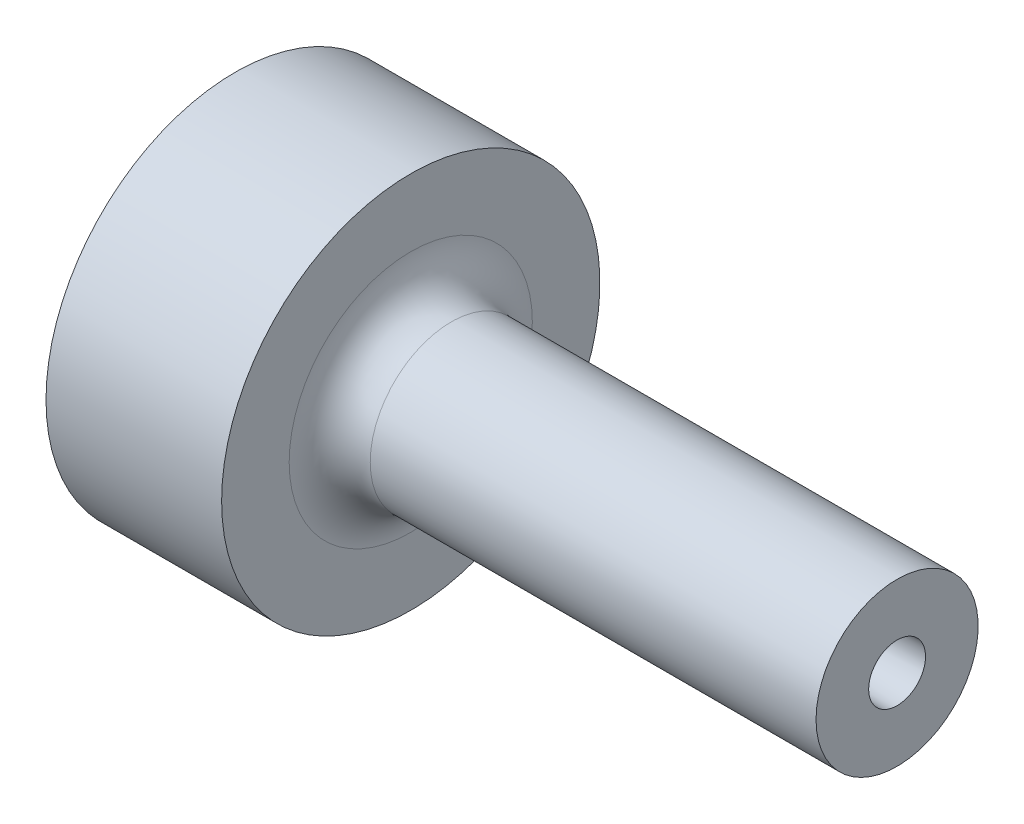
ISO-10303-21;
HEADER;
FILE_DESCRIPTION(('STEP AP214'),'2;1');
FILE_NAME('part.step','',(''),(''),'','','');
FILE_SCHEMA(('AUTOMOTIVE_DESIGN { 1 0 10303 214 1 1 1 1 }'));
ENDSEC;
DATA;
#1=APPLICATION_CONTEXT('core data for automotive mechanical design processes');
#2=APPLICATION_PROTOCOL_DEFINITION('international standard','automotive_design',2000,#1);
#3=PRODUCT_CONTEXT('',#1,'mechanical');
#4=PRODUCT('Part','Part','',(#3));
#5=PRODUCT_RELATED_PRODUCT_CATEGORY('part','',(#4));
#6=PRODUCT_DEFINITION_FORMATION('','',#4);
#7=PRODUCT_DEFINITION_CONTEXT('part definition',#1,'design');
#8=PRODUCT_DEFINITION('design','',#6,#7);
#9=PRODUCT_DEFINITION_SHAPE('','',#8);
#10=(LENGTH_UNIT() NAMED_UNIT(*) SI_UNIT(.MILLI.,.METRE.));
#11=(NAMED_UNIT(*) PLANE_ANGLE_UNIT() SI_UNIT($,.RADIAN.));
#12=(NAMED_UNIT(*) SI_UNIT($,.STERADIAN.) SOLID_ANGLE_UNIT());
#13=UNCERTAINTY_MEASURE_WITH_UNIT(LENGTH_MEASURE(1.E-05),#10,'distance_accuracy_value','');
#14=(GEOMETRIC_REPRESENTATION_CONTEXT(3) GLOBAL_UNCERTAINTY_ASSIGNED_CONTEXT((#13)) GLOBAL_UNIT_ASSIGNED_CONTEXT((#10,
#11,#12)) REPRESENTATION_CONTEXT('',''));
#15=CARTESIAN_POINT('',(0.,0.,0.));
#16=DIRECTION('',(0.,0.,1.));
#17=DIRECTION('',(1.,0.,0.));
#18=AXIS2_PLACEMENT_3D('',#15,#16,#17);
#19=CARTESIAN_POINT('',(0.,0.,0.));
#20=DIRECTION('',(-1.,0.,0.));
#21=DIRECTION('',(0.,0.,1.));
#22=AXIS2_PLACEMENT_3D('',#19,#20,#21);
#23=CYLINDRICAL_SURFACE('',#22,14.);
#24=CARTESIAN_POINT('',(13.,0.,0.));
#25=DIRECTION('',(-1.,0.,0.));
#26=DIRECTION('',(0.,0.,1.));
#27=AXIS2_PLACEMENT_3D('',#24,#25,#26);
#28=CIRCLE('',#27,14.);
#29=CARTESIAN_POINT('',(13.,0.,14.));
#30=VERTEX_POINT('',#29);
#31=EDGE_CURVE('E88',#30,#30,#28,.T.);
#32=ORIENTED_EDGE('',*,*,#31,.T.);
#33=EDGE_LOOP('',(#32));
#34=FACE_BOUND('',#33,.T.);
#35=CARTESIAN_POINT('',(0.,0.,0.));
#36=DIRECTION('',(-1.,0.,0.));
#37=DIRECTION('',(0.,0.,1.));
#38=AXIS2_PLACEMENT_3D('',#35,#36,#37);
#39=CIRCLE('',#38,14.);
#40=CARTESIAN_POINT('',(0.,0.,14.));
#41=VERTEX_POINT('',#40);
#42=EDGE_CURVE('E83',#41,#41,#39,.T.);
#43=ORIENTED_EDGE('',*,*,#42,.F.);
#44=EDGE_LOOP('',(#43));
#45=FACE_BOUND('',#44,.T.);
#46=CARTESIAN_POINT('',(6.5,-13.856406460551,-2.));
#47=CARTESIAN_POINT('',(6.61172417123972,-13.8564082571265,-1.99999534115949));
#48=CARTESIAN_POINT('',(6.72351471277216,-13.8577723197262,-1.99060664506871));
#49=CARTESIAN_POINT('',(6.9439746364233,-13.8630779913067,-1.95330740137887));
#50=CARTESIAN_POINT('',(7.05264079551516,-13.8670221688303,-1.92537839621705));
#51=CARTESIAN_POINT('',(7.26362870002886,-13.8770324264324,-1.85184738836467));
#52=CARTESIAN_POINT('',(7.36595507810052,-13.8830969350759,-1.80625847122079));
#53=CARTESIAN_POINT('',(7.56148972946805,-13.8966626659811,-1.69873175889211));
#54=CARTESIAN_POINT('',(7.65469934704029,-13.9041636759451,-1.63679637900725));
#55=CARTESIAN_POINT('',(7.83004829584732,-13.9198182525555,-1.49785346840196));
#56=CARTESIAN_POINT('',(7.91211171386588,-13.9279757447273,-1.42075056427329));
#57=CARTESIAN_POINT('',(8.06218155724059,-13.9439890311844,-1.25386707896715));
#58=CARTESIAN_POINT('',(8.13018723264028,-13.9518448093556,-1.16408582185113));
#59=CARTESIAN_POINT('',(8.25048909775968,-13.9664103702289,-0.973910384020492));
#60=CARTESIAN_POINT('',(8.30271571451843,-13.9731150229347,-0.873471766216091));
#61=CARTESIAN_POINT('',(8.38953073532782,-13.9845795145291,-0.665136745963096));
#62=CARTESIAN_POINT('',(8.4241199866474,-13.9893394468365,-0.557240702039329));
#63=CARTESIAN_POINT('',(8.47444920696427,-13.9963505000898,-0.337834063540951));
#64=CARTESIAN_POINT('',(8.49031606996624,-13.9986185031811,-0.226353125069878));
#65=CARTESIAN_POINT('',(8.5031438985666,-14.0004479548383,-0.00228956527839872));
#66=CARTESIAN_POINT('',(8.50010582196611,-14.0000095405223,0.110292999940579));
#67=CARTESIAN_POINT('',(8.47531062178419,-13.9964890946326,0.33249899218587));
#68=CARTESIAN_POINT('',(8.45369000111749,-13.9934263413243,0.442137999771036));
#69=CARTESIAN_POINT('',(8.39255744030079,-13.9850228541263,0.656215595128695));
#70=CARTESIAN_POINT('',(8.3530450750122,-13.9796820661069,0.760654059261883));
#71=CARTESIAN_POINT('',(8.25710925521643,-13.9672894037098,0.961781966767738));
#72=CARTESIAN_POINT('',(8.20062784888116,-13.9602316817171,1.05844339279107));
#73=CARTESIAN_POINT('',(8.07239950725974,-13.9451926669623,1.24096782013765));
#74=CARTESIAN_POINT('',(8.00065165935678,-13.9372113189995,1.32683017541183));
#75=CARTESIAN_POINT('',(7.843165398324,-13.921132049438,1.48612299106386));
#76=CARTESIAN_POINT('',(7.75730786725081,-13.9130337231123,1.55943569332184));
#77=CARTESIAN_POINT('',(7.57444547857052,-13.8977029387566,1.69062989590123));
#78=CARTESIAN_POINT('',(7.47744056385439,-13.890470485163,1.74851131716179));
#79=CARTESIAN_POINT('',(7.27491971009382,-13.8776905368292,1.84721301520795));
#80=CARTESIAN_POINT('',(7.1693981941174,-13.8721441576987,1.88802200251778));
#81=CARTESIAN_POINT('',(6.95290242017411,-13.8633846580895,1.9513062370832));
#82=CARTESIAN_POINT('',(6.84192850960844,-13.8601713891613,1.97378265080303));
#83=CARTESIAN_POINT('',(6.61872346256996,-13.8564698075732,1.99960390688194));
#84=CARTESIAN_POINT('',(6.50651197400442,-13.8559577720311,2.00311531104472));
#85=CARTESIAN_POINT('',(6.28310219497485,-13.8576537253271,1.9913480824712));
#86=CARTESIAN_POINT('',(6.17190387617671,-13.8598616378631,1.9760699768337));
#87=CARTESIAN_POINT('',(5.95418781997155,-13.8667269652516,1.92729837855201));
#88=CARTESIAN_POINT('',(5.84765127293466,-13.8713733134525,1.8938871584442));
#89=CARTESIAN_POINT('',(5.6416912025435,-13.8825829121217,1.80988306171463));
#90=CARTESIAN_POINT('',(5.54226800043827,-13.8891462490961,1.75928940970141));
#91=CARTESIAN_POINT('',(5.35260812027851,-13.9035064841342,1.64195360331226));
#92=CARTESIAN_POINT('',(5.26243903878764,-13.911311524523,1.57510320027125));
#93=CARTESIAN_POINT('',(5.09454027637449,-13.9272509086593,1.42730277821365));
#94=CARTESIAN_POINT('',(5.01681123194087,-13.9353852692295,1.34635203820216));
#95=CARTESIAN_POINT('',(4.8754047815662,-13.9511405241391,1.17191708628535));
#96=CARTESIAN_POINT('',(4.81183747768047,-13.9587570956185,1.07834317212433));
#97=CARTESIAN_POINT('',(4.70132443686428,-13.972552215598,0.881748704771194));
#98=CARTESIAN_POINT('',(4.65437828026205,-13.9787308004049,0.778728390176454));
#99=CARTESIAN_POINT('',(4.57861788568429,-13.9889347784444,0.566515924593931));
#100=CARTESIAN_POINT('',(4.54974241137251,-13.9929674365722,0.457345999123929));
#101=CARTESIAN_POINT('',(4.51074453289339,-13.9984555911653,0.235645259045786));
#102=CARTESIAN_POINT('',(4.50062101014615,-13.9999112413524,0.123114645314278));
#103=CARTESIAN_POINT('',(4.49943976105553,-14.0000800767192,-0.101043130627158));
#104=CARTESIAN_POINT('',(4.50821318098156,-13.998817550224,-0.212669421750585));
#105=CARTESIAN_POINT('',(4.54421615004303,-13.9937406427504,-0.432842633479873));
#106=CARTESIAN_POINT('',(4.57144565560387,-13.989926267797,-0.541389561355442));
#107=CARTESIAN_POINT('',(4.6435299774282,-13.9801722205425,-0.752283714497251));
#108=CARTESIAN_POINT('',(4.68837418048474,-13.9742338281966,-0.854634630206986));
#109=CARTESIAN_POINT('',(4.79439714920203,-13.960885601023,-1.05038570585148));
#110=CARTESIAN_POINT('',(4.8555763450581,-13.9534757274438,-1.14378562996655));
#111=CARTESIAN_POINT('',(4.99314771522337,-13.9379304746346,-1.31984194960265));
#112=CARTESIAN_POINT('',(5.06966490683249,-13.9297894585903,-1.40240016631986));
#113=CARTESIAN_POINT('',(5.2354775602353,-13.9137422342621,-1.55356716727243));
#114=CARTESIAN_POINT('',(5.32477602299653,-13.9058360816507,-1.6221726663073));
#115=CARTESIAN_POINT('',(5.51414543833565,-13.8911108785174,-1.74379523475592));
#116=CARTESIAN_POINT('',(5.61426869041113,-13.8842975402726,-1.79673154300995));
#117=CARTESIAN_POINT('',(5.82203229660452,-13.8725962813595,-1.88495902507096));
#118=CARTESIAN_POINT('',(5.92966459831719,-13.8677063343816,-1.92026877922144));
#119=CARTESIAN_POINT('',(6.11483642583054,-13.8615529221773,-1.96409255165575));
#120=CARTESIAN_POINT('',(6.19122433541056,-13.859633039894,-1.97753762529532));
#121=CARTESIAN_POINT('',(6.34506419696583,-13.857059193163,-1.99549291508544));
#122=CARTESIAN_POINT('',(6.42251613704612,-13.8564052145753,-2.00000323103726));
#123=CARTESIAN_POINT('',(6.5,-13.856406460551,-2.));
#124=B_SPLINE_CURVE_WITH_KNOTS('',3,(#46,#47,#48,#49,#50,#51,#52,#53,#54,#55,#56,#57,#58,#59,
#60,#61,#62,#63,#64,#65,#66,#67,#68,#69,#70,#71,#72,#73,#74,#75,#76,#77,#78,#79,#80,#81,#82,#83,
#84,#85,#86,#87,#88,#89,#90,#91,#92,#93,#94,#95,#96,#97,#98,#99,#100,#101,#102,#103,#104,#105,
#106,#107,#108,#109,#110,#111,#112,#113,#114,#115,#116,#117,#118,#119,#120,#121,#122,#123),
.UNSPECIFIED.,.T.,.F.,(4,2,2,2,2,2,2,2,2,2,2,2,2,2,2,2,2,2,2,2,2,2,2,2,2,2,2,2,2,2,2,2,2,2,2,2,
2,2,4),(0.,0.334889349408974,0.670112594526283,1.00508792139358,1.34001378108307,
1.6771171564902,2.01423851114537,2.35282530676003,2.6913958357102,3.02765822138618,
3.36390357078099,3.69769984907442,4.03150405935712,4.36646147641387,4.70143892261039,
5.03940517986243,5.37737316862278,5.7155642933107,6.05373389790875,6.3889286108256,
6.72411392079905,7.05779100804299,7.39148315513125,7.72746121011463,8.06345644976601,
8.40197921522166,8.74049343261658,9.07785422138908,9.41519488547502,9.74953375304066,
10.083871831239,10.4180087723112,10.7521545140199,11.0891434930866,11.426211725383,
11.7649881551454,12.103406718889,12.3356645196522,12.5679197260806),.UNSPECIFIED.);
#125=CARTESIAN_POINT('',(6.5,-13.856406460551,-2.));
#126=VERTEX_POINT('',#125);
#127=EDGE_CURVE('E9',#126,#126,#124,.T.);
#128=ORIENTED_EDGE('',*,*,#127,.F.);
#129=EDGE_LOOP('',(#128));
#130=FACE_BOUND('',#129,.T.);
#131=ADVANCED_FACE('F15',(#34,#45,#130),#23,.T.);
#132=CARTESIAN_POINT('',(0.,0.,0.));
#133=DIRECTION('',(1.,0.,0.));
#134=DIRECTION('',(0.,0.,-1.));
#135=AXIS2_PLACEMENT_3D('',#132,#133,#134);
#136=CONICAL_SURFACE('',#135,1.25,0.0174532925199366);
#137=CARTESIAN_POINT('',(49.,0.,0.));
#138=DIRECTION('',(-1.,0.,0.));
#139=DIRECTION('',(0.,0.,1.));
#140=AXIS2_PLACEMENT_3D('',#137,#138,#139);
#141=CIRCLE('',#140,2.10529818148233);
#142=CARTESIAN_POINT('',(49.,0.,2.10529818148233));
#143=VERTEX_POINT('',#142);
#144=EDGE_CURVE('E80',#143,#143,#141,.T.);
#145=ORIENTED_EDGE('',*,*,#144,.F.);
#146=EDGE_LOOP('',(#145));
#147=FACE_BOUND('',#146,.T.);
#148=CARTESIAN_POINT('',(0.924407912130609,0.,0.));
#149=DIRECTION('',(-1.,0.,0.));
#150=DIRECTION('',(0.,0.,1.));
#151=AXIS2_PLACEMENT_3D('',#148,#149,#150);
#152=CIRCLE('',#151,1.26613560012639);
#153=CARTESIAN_POINT('',(0.924407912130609,0.,1.26613560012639));
#154=VERTEX_POINT('',#153);
#155=EDGE_CURVE('E93',#154,#154,#152,.F.);
#156=ORIENTED_EDGE('',*,*,#155,.F.);
#157=EDGE_LOOP('',(#156));
#158=FACE_BOUND('',#157,.T.);
#159=ADVANCED_FACE('F44',(#147,#158),#136,.F.);
#160=CARTESIAN_POINT('',(16.,0.,0.));
#161=DIRECTION('',(-1.,0.,0.));
#162=DIRECTION('',(0.,0.,1.));
#163=AXIS2_PLACEMENT_3D('',#160,#161,#162);
#164=TOROIDAL_SURFACE('',#163,9.,3.);
#165=CARTESIAN_POINT('',(13.,0.,0.));
#166=DIRECTION('',(-1.,0.,0.));
#167=DIRECTION('',(0.,0.,1.));
#168=AXIS2_PLACEMENT_3D('',#165,#166,#167);
#169=CIRCLE('',#168,9.);
#170=CARTESIAN_POINT('',(13.,0.,9.));
#171=VERTEX_POINT('',#170);
#172=EDGE_CURVE('E90',#171,#171,#169,.T.);
#173=ORIENTED_EDGE('',*,*,#172,.F.);
#174=EDGE_LOOP('',(#173));
#175=FACE_BOUND('',#174,.T.);
#176=CARTESIAN_POINT('',(16.,0.,0.));
#177=DIRECTION('',(-1.,0.,0.));
#178=DIRECTION('',(0.,0.,1.));
#179=AXIS2_PLACEMENT_3D('',#176,#177,#178);
#180=CIRCLE('',#179,6.);
#181=CARTESIAN_POINT('',(16.,0.,6.));
#182=VERTEX_POINT('',#181);
#183=EDGE_CURVE('E27',#182,#182,#180,.T.);
#184=ORIENTED_EDGE('',*,*,#183,.T.);
#185=EDGE_LOOP('',(#184));
#186=FACE_BOUND('',#185,.T.);
#187=ADVANCED_FACE('F17',(#175,#186),#164,.F.);
#188=CARTESIAN_POINT('',(0.,0.,0.));
#189=DIRECTION('',(-1.,0.,0.));
#190=DIRECTION('',(0.,0.,1.));
#191=AXIS2_PLACEMENT_3D('',#188,#189,#190);
#192=CYLINDRICAL_SURFACE('',#191,6.);
#193=ORIENTED_EDGE('',*,*,#183,.F.);
#194=EDGE_LOOP('',(#193));
#195=FACE_BOUND('',#194,.T.);
#196=CARTESIAN_POINT('',(49.,0.,0.));
#197=DIRECTION('',(-1.,0.,0.));
#198=DIRECTION('',(0.,0.,1.));
#199=AXIS2_PLACEMENT_3D('',#196,#197,#198);
#200=CIRCLE('',#199,6.);
#201=CARTESIAN_POINT('',(49.,0.,6.));
#202=VERTEX_POINT('',#201);
#203=EDGE_CURVE('E79',#202,#202,#200,.T.);
#204=ORIENTED_EDGE('',*,*,#203,.T.);
#205=EDGE_LOOP('',(#204));
#206=FACE_BOUND('',#205,.T.);
#207=ADVANCED_FACE('F65',(#195,#206),#192,.T.);
#208=CARTESIAN_POINT('',(49.,6.,0.));
#209=DIRECTION('',(-1.,0.,0.));
#210=DIRECTION('',(0.,0.,1.));
#211=AXIS2_PLACEMENT_3D('',#208,#209,#210);
#212=PLANE('',#211);
#213=ORIENTED_EDGE('',*,*,#203,.F.);
#214=EDGE_LOOP('',(#213));
#215=FACE_BOUND('',#214,.T.);
#216=ORIENTED_EDGE('',*,*,#144,.T.);
#217=EDGE_LOOP('',(#216));
#218=FACE_BOUND('',#217,.T.);
#219=ADVANCED_FACE('F61',(#215,#218),#212,.F.);
#220=CARTESIAN_POINT('',(0.,1.25,0.));
#221=DIRECTION('',(1.,0.,0.));
#222=DIRECTION('',(0.,0.,-1.));
#223=AXIS2_PLACEMENT_3D('',#220,#221,#222);
#224=PLANE('',#223);
#225=CARTESIAN_POINT('',(0.,0.,0.));
#226=DIRECTION('',(-1.,0.,0.));
#227=DIRECTION('',(0.,0.,1.));
#228=AXIS2_PLACEMENT_3D('',#225,#226,#227);
#229=CIRCLE('',#228,5.);
#230=CARTESIAN_POINT('',(0.,0.,5.));
#231=VERTEX_POINT('',#230);
#232=EDGE_CURVE('E96',#231,#231,#229,.T.);
#233=ORIENTED_EDGE('',*,*,#232,.F.);
#234=EDGE_LOOP('',(#233));
#235=FACE_BOUND('',#234,.T.);
#236=ORIENTED_EDGE('',*,*,#42,.T.);
#237=EDGE_LOOP('',(#236));
#238=FACE_BOUND('',#237,.T.);
#239=ADVANCED_FACE('F59',(#235,#238),#224,.F.);
#240=CARTESIAN_POINT('',(13.,14.,0.));
#241=DIRECTION('',(-1.,0.,0.));
#242=DIRECTION('',(0.,0.,1.));
#243=AXIS2_PLACEMENT_3D('',#240,#241,#242);
#244=PLANE('',#243);
#245=ORIENTED_EDGE('',*,*,#31,.F.);
#246=EDGE_LOOP('',(#245));
#247=FACE_BOUND('',#246,.T.);
#248=ORIENTED_EDGE('',*,*,#172,.T.);
#249=EDGE_LOOP('',(#248));
#250=FACE_BOUND('',#249,.T.);
#251=ADVANCED_FACE('F57',(#247,#250),#244,.F.);
#252=CARTESIAN_POINT('',(-14.4672767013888,0.,0.));
#253=DIRECTION('',(-1.,0.,0.));
#254=DIRECTION('',(0.,0.,1.));
#255=AXIS2_PLACEMENT_3D('',#252,#253,#254);
#256=DEGENERATE_TOROIDAL_SURFACE('',#255,0.56308411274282,15.5,.F.);
#257=ORIENTED_EDGE('',*,*,#232,.T.);
#258=EDGE_LOOP('',(#257));
#259=FACE_BOUND('',#258,.T.);
#260=ORIENTED_EDGE('',*,*,#155,.T.);
#261=EDGE_LOOP('',(#260));
#262=FACE_BOUND('',#261,.T.);
#263=ADVANCED_FACE('F40',(#259,#262),#256,.T.);
#264=CARTESIAN_POINT('',(6.5,-14.,0.));
#265=DIRECTION('',(0.,-1.,0.));
#266=DIRECTION('',(0.,0.,-1.));
#267=AXIS2_PLACEMENT_3D('',#264,#265,#266);
#268=CYLINDRICAL_SURFACE('',#267,2.);
#269=CARTESIAN_POINT('',(6.5,-8.,0.));
#270=DIRECTION('',(0.,-1.,0.));
#271=DIRECTION('',(0.,0.,-1.));
#272=AXIS2_PLACEMENT_3D('',#269,#270,#271);
#273=CIRCLE('',#272,2.);
#274=CARTESIAN_POINT('',(6.5,-8.,-2.));
#275=VERTEX_POINT('',#274);
#276=EDGE_CURVE('E99',#275,#275,#273,.T.);
#277=ORIENTED_EDGE('',*,*,#276,.F.);
#278=EDGE_LOOP('',(#277));
#279=FACE_BOUND('',#278,.T.);
#280=ORIENTED_EDGE('',*,*,#127,.T.);
#281=EDGE_LOOP('',(#280));
#282=FACE_BOUND('',#281,.T.);
#283=ADVANCED_FACE('F32',(#279,#282),#268,.F.);
#284=CARTESIAN_POINT('',(6.5,-6.84529946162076,0.));
#285=DIRECTION('',(0.,-1.,0.));
#286=DIRECTION('',(0.,0.,-1.));
#287=AXIS2_PLACEMENT_3D('',#284,#285,#286);
#288=CONICAL_SURFACE('',#287,0.,1.0471975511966);
#289=ORIENTED_EDGE('',*,*,#276,.T.);
#290=EDGE_LOOP('',(#289));
#291=FACE_BOUND('',#290,.T.);
#292=CARTESIAN_POINT('',(6.5,-6.84529946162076,0.));
#293=VERTEX_POINT('',#292);
#294=VERTEX_LOOP('',#293);
#295=FACE_BOUND('',#294,.T.);
#296=ADVANCED_FACE('F30',(#291,#295),#288,.F.);
#297=CLOSED_SHELL('',(#131,#159,#187,#207,#219,#239,#251,#263,#283,#296));
#298=MANIFOLD_SOLID_BREP('B1',#297);
#299=ADVANCED_BREP_SHAPE_REPRESENTATION('',(#18,#298),#14);
#300=SHAPE_DEFINITION_REPRESENTATION(#9,#299);
ENDSEC;
END-ISO-10303-21;
